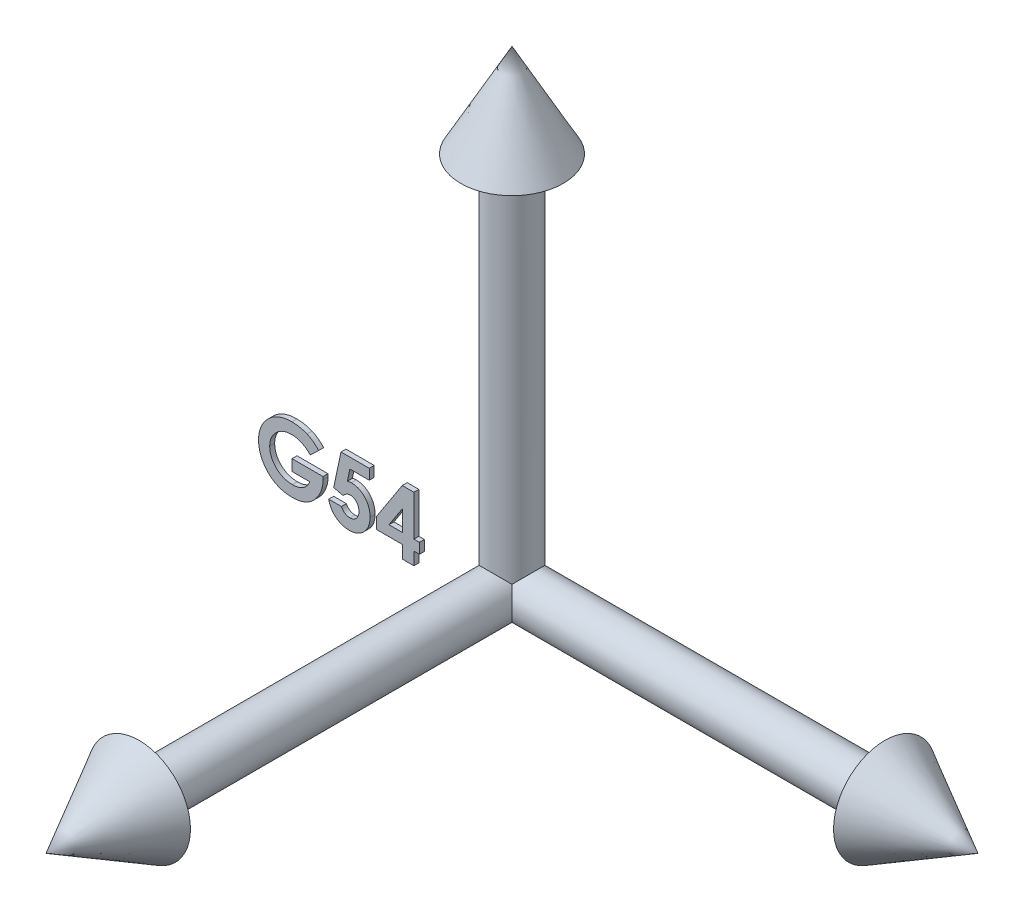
from build123d import *

# Parameters (mm, degrees)
SKETCH2_R             = 6.35
BOSS_EXTRUDE1_DEPTH   = 101.6
SKETCH4_R             = 13.97
SKETCH5_R             = 6.35
BOSS_EXTRUDE2_DEPTH   = 101.6
SKETCH7_R             = 13.97
SKETCH8_R             = 6.35
BOSS_EXTRUDE3_DEPTH   = 101.6
SKETCH10_R            = 13.97
SCALE1_SCALE          = 0.1875
BOSS_EXTRUDE4_DEPTH   = 0.127
BOSS_EXTRUDE4_2_DEPTH = 0.127
BOSS_EXTRUDE4_3_DEPTH = 0.127


with BuildPart() as part:
    # Sketch2 → Boss-Extrude1 (new body)
    with BuildSketch(Plane.XY):
        Circle(SKETCH2_R)
    extrude(amount=BOSS_EXTRUDE1_DEPTH)

    # Sketch4 → Loft1 section 0
    with BuildSketch(Plane.XY.offset(101.6), mode=Mode.PRIVATE) as loft1_s0:
        Circle(SKETCH4_R)
    loft([Vertex(0, 0, 127), loft1_s0.sketch])


with BuildPart() as body_2:
    # Sketch5 → Boss-Extrude2 (new body)
    with BuildSketch(Plane(origin=(0, 0, 0), x_dir=(0, 0, -1), z_dir=(1, 0, 0))):
        Circle(SKETCH5_R)
    extrude(amount=BOSS_EXTRUDE2_DEPTH)

    # Sketch7 → Loft2 section 0
    with BuildSketch(Plane(origin=(101.6, 0, 0), x_dir=(0, 0, -1), z_dir=(1, 0, 0)), mode=Mode.PRIVATE) as loft2_s0:
        Circle(SKETCH7_R)
    loft([loft2_s0.sketch, Vertex(127, 0, 0)])


with BuildPart() as body_3:
    # Sketch8 → Boss-Extrude3 (new body)
    with BuildSketch(Plane(origin=(0, 0, 0), x_dir=(1, 0, 0), z_dir=(0, 1, 0))):
        with Locations(Location((0, 0, 0), (0, 0, 270))):
            Circle(SKETCH8_R)
    extrude(amount=BOSS_EXTRUDE3_DEPTH)

    # Sketch10 → Loft3 section 0
    with BuildSketch(Plane(origin=(0, 101.6, 0), x_dir=(1, 0, 0), z_dir=(0, 1, 0)), mode=Mode.PRIVATE) as loft3_s0:
        Circle(SKETCH10_R)
    loft([loft3_s0.sketch, Vertex(0, 127, 0)])


with BuildPart() as part_1:
    # Scale1: scaled about (0, 0, 0)
    add(part.part.scale(SCALE1_SCALE))


with BuildPart() as body_2_1:
    # Scale1: scaled about (0, 0, 0)
    add(body_2.part.scale(SCALE1_SCALE))


with BuildPart() as body_3_1:
    # Scale1: scaled about (0, 0, 0)
    add(body_3.part.scale(SCALE1_SCALE))

    # Combine1: union body 2, part
    add(body_2_1.part)
    add(part_1.part)


with BuildPart() as body_4:
    # Sketch12 → Boss-Extrude4 (new, symmetric)
    with BuildSketch(Plane.XY):
        with BuildLine():
            Line((-9.751438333, 1.110672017), (-10.182658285, 0.697896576))
            add(Edge.make_bspline(
                [(-10.182658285, 0.697896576), (-10.216798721, 0.732077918), (-10.283787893, 0.799147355), (-10.393340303, 0.886442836), (-10.506803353, 0.960661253), (-10.624550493, 1.021688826), (-10.746745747, 1.069027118), (-10.87314797, 1.102889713), (-11.003962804, 1.122974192), (-11.092518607, 1.125785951), (-11.137320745, 1.127208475)],
                knots=[0, 0, 0, 0, 1.075575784, 2.110457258, 3.113929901, 4.09197124, 5.059417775, 6.02750972, 7.002078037, 8, 8, 8, 8], degree=3))
            add(Edge.make_bspline(
                [(-11.137320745, 1.127208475), (-11.176162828, 1.126211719), (-11.252432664, 1.1242545), (-11.364503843, 1.109391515), (-11.471594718, 1.084563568), (-11.574211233, 1.050168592), (-11.671726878, 1.005409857), (-11.764706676, 0.950978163), (-11.85257843, 0.886457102), (-11.934650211, 0.813069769), (-12.009376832, 0.732945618), (-12.074617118, 0.647184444), (-12.130187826, 0.557384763), (-12.175933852, 0.463087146), (-12.210741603, 0.364436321), (-12.235589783, 0.261503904), (-12.251362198, 0.154589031), (-12.253224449, 0.081650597), (-12.2541677, 0.044706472)],
                knots=[0, 0, 0, 0, 1.075001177, 2.110859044, 3.123021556, 4.114053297, 5.101481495, 6.087880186, 7.091499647, 8.114004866, 9.131394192, 10.11971144, 11.092043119, 12.050101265, 13.015322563, 13.981809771, 14.977764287, 16, 16, 16, 16], degree=3))
            add(Edge.make_bspline(
                [(-12.2541677, 0.044706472), (-12.253287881, 0.006483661), (-12.251554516, -0.068820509), (-12.234903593, -0.179332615), (-12.209249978, -0.285653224), (-12.171699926, -0.386993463), (-12.125487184, -0.484741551), (-12.066881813, -0.577004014), (-11.998542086, -0.665189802), (-11.920590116, -0.747763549), (-11.835798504, -0.823876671), (-11.743966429, -0.88953381), (-11.647887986, -0.946181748), (-11.546012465, -0.991045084), (-11.440108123, -1.027065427), (-11.329100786, -1.052462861), (-11.213240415, -1.068044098), (-11.134189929, -1.069917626), (-11.094071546, -1.070868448)],
                knots=[0, 0, 0, 0, 1.022067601, 2.013613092, 2.983553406, 3.943623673, 4.90013463, 5.87121881, 6.861774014, 7.881098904, 8.905697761, 9.905387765, 10.89678721, 11.884561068, 12.87834324, 13.885584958, 14.926927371, 16, 16, 16, 16], degree=3))
            add(Edge.make_bspline(
                [(-11.094071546, -1.070868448), (-11.067976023, -1.070632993), (-11.016744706, -1.070170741), (-10.941597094, -1.062667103), (-10.869623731, -1.051939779), (-10.800545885, -1.037738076), (-10.735061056, -1.017640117), (-10.672262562, -0.99413803), (-10.612518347, -0.966400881), (-10.556152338, -0.933471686), (-10.502325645, -0.896562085), (-10.451542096, -0.854329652), (-10.402910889, -0.807726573), (-10.357000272, -0.756183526), (-10.314587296, -0.699239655), (-10.274313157, -0.63794138), (-10.236638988, -0.571680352), (-10.214378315, -0.524890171), (-10.203010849, -0.500996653)],
                knots=[0, 0, 0, 0, 1.109579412, 2.178351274, 3.208885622, 4.204702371, 5.174744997, 6.119429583, 7.05542196, 7.97267548, 8.893247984, 9.828544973, 10.778894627, 11.756245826, 12.760884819, 13.796418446, 14.874735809, 16, 16, 16, 16], degree=3))
            Line((-10.203010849, -0.500996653), (-11.11442411, -0.500996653))
            Line((-11.11442411, -0.500996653), (-11.11442411, 0.068875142))
            Line((-11.11442411, 0.068875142), (-9.531376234, 0.068875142))
            Line((-9.531376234, 0.068875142), (-9.52692411, -0.066596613))
            add(Edge.make_bspline(
                [(-9.52692411, -0.066596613), (-9.527496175, -0.101389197), (-9.528639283, -0.170912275), (-9.539086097, -0.274420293), (-9.556391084, -0.376555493), (-9.580048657, -0.477215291), (-9.609697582, -0.57689346), (-9.647509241, -0.674635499), (-9.691786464, -0.771104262), (-9.74139595, -0.865889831), (-9.797142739, -0.956839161), (-9.857162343, -1.042956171), (-9.920599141, -1.12409181), (-9.988832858, -1.199115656), (-10.060800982, -1.268657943), (-10.136645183, -1.332451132), (-10.21663372, -1.390549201), (-10.300342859, -1.443442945), (-10.388249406, -1.489801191), (-10.47987005, -1.530126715), (-10.575066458, -1.564374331), (-10.674084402, -1.592449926), (-10.776729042, -1.614112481), (-10.883002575, -1.628966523), (-10.992963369, -1.639060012), (-11.06754745, -1.640173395), (-11.105519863, -1.640740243)],
                knots=[0, 0, 0, 0, 1.006889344, 2.011981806, 3.007738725, 4.003571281, 5.003404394, 6.015442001, 7.03424805, 8.074616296, 9.110249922, 10.119753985, 11.111721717, 12.089233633, 13.052717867, 14.006597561, 14.955430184, 15.912305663, 16.870361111, 17.829300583, 18.807640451, 19.796414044, 20.806216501, 21.841577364, 22.90109906, 24, 24, 24, 24], degree=3))
            add(Edge.make_bspline(
                [(-11.105519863, -1.640740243), (-11.146033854, -1.64018047), (-11.226344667, -1.639070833), (-11.345094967, -1.628678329), (-11.460400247, -1.611526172), (-11.572289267, -1.587788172), (-11.681021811, -1.558244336), (-11.786411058, -1.521159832), (-11.888241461, -1.477046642), (-11.986817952, -1.427072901), (-12.080880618, -1.370398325), (-12.170218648, -1.30801671), (-12.254344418, -1.239526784), (-12.334119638, -1.166075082), (-12.40768045, -1.085856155), (-12.477768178, -1.001470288), (-12.54098731, -0.909822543), (-12.600056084, -0.813884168), (-12.652533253, -0.713695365), (-12.698425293, -0.611109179), (-12.737561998, -0.506719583), (-12.768422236, -0.400040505), (-12.79347786, -0.2918158), (-12.811405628, -0.181574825), (-12.821530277, -0.069331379), (-12.823199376, 0.006102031), (-12.824039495, 0.044070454)],
                knots=[0, 0, 0, 0, 1.084149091, 2.14910686, 3.187506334, 4.202448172, 5.208724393, 6.201130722, 7.189831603, 8.176984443, 9.156919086, 10.126598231, 11.090766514, 12.05840148, 13.026036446, 14.001772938, 14.991905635, 16.003017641, 17.015720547, 18.016462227, 19.009322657, 19.99686681, 20.986544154, 21.980959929, 22.983742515, 24, 24, 24, 24], degree=3))
            add(Edge.make_bspline(
                [(-12.824039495, 0.044070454), (-12.822914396, 0.095867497), (-12.820692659, 0.198151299), (-12.800116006, 0.348815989), (-12.768040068, 0.494569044), (-12.722007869, 0.63487964), (-12.662937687, 0.769941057), (-12.591666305, 0.900070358), (-12.506645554, 1.025129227), (-12.440833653, 1.102558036), (-12.407447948, 1.14183688)],
                knots=[0, 0, 0, 0, 1.034044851, 2.041932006, 3.031217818, 4.011390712, 4.986069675, 5.97149666, 6.970960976, 8, 8, 8, 8], degree=3))
            add(Edge.make_bspline(
                [(-12.407447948, 1.14183688), (-12.38671909, 1.164560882), (-12.345572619, 1.209667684), (-12.279800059, 1.272344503), (-12.212359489, 1.331263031), (-12.142316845, 1.385173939), (-12.07004033, 1.435257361), (-11.995321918, 1.480574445), (-11.918553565, 1.52256811), (-11.839136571, 1.559094), (-11.757486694, 1.591842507), (-11.673242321, 1.619552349), (-11.587034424, 1.644096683), (-11.49809963, 1.662768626), (-11.407336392, 1.678317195), (-11.314100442, 1.688738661), (-11.218645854, 1.696376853), (-11.154085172, 1.696843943), (-11.121420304, 1.69708027)],
                knots=[0, 0, 0, 0, 1.020590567, 2.025856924, 3.013483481, 3.991664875, 4.957826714, 5.930500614, 6.890802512, 7.860442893, 8.829981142, 9.809047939, 10.802672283, 11.803273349, 12.823572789, 13.857849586, 14.916166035, 16, 16, 16, 16], degree=3))
            add(Edge.make_bspline(
                [(-11.121420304, 1.69708027), (-11.087274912, 1.696553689), (-11.019338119, 1.695505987), (-10.918327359, 1.688256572), (-10.818720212, 1.677072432), (-10.72093643, 1.660295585), (-10.624647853, 1.63960624), (-10.530352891, 1.613098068), (-10.437436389, 1.58298001), (-10.376948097, 1.558967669), (-10.346750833, 1.54698011)],
                knots=[0, 0, 0, 0, 1.03180557, 2.052914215, 3.058998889, 4.059601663, 5.049854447, 6.033765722, 7.018406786, 8, 8, 8, 8], degree=3))
            add(Edge.make_bspline(
                [(-10.346750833, 1.54698011), (-10.32134357, 1.535901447), (-10.269665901, 1.513367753), (-10.194481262, 1.472141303), (-10.119112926, 1.426437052), (-10.044374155, 1.374583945), (-9.970378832, 1.316678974), (-9.896354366, 1.253636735), (-9.823056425, 1.184722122), (-9.775620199, 1.135675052), (-9.751438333, 1.110672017)],
                knots=[0, 0, 0, 0, 0.894392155, 1.819168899, 2.76525314, 3.739198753, 4.75366411, 5.797420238, 6.877176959, 8, 8, 8, 8], degree=3))
        make_face()
    extrude(amount=BOSS_EXTRUDE4_DEPTH, both=True)


with BuildPart() as body_5:
    # Sketch12 → Boss-Extrude4 2 (new, symmetric)
    with BuildSketch(Plane.XY):
        with BuildLine():
            Line((-8.611694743, 1.615670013), (-7.166026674, 1.615670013))
            Line((-7.166026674, 1.615670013), (-7.166026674, 1.086503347))
            Line((-7.166026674, 1.086503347), (-8.160122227, 1.086503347))
            Line((-8.160122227, 1.086503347), (-8.284145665, 0.486102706))
            add(Edge.make_bspline(
                [(-8.284145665, 0.486102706), (-8.267245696, 0.49080956), (-8.233915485, 0.500092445), (-8.183703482, 0.509402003), (-8.135041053, 0.515436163), (-8.103109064, 0.51624104), (-8.087616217, 0.516631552)],
                knots=[0, 0, 0, 0, 1.05461699, 2.079921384, 3.068411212, 4, 4, 4, 4], degree=3))
            add(Edge.make_bspline(
                [(-8.087616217, 0.516631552), (-8.053855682, 0.515857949), (-7.987306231, 0.514333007), (-7.889952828, 0.499856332), (-7.796731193, 0.477056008), (-7.707926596, 0.444538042), (-7.623625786, 0.402215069), (-7.543726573, 0.351016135), (-7.468130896, 0.290851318), (-7.398181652, 0.221682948), (-7.333909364, 0.145734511), (-7.278028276, 0.063588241), (-7.230302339, -0.023584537), (-7.192342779, -0.116325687), (-7.162381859, -0.214052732), (-7.140731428, -0.316828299), (-7.127928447, -0.424774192), (-7.126202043, -0.498417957), (-7.125321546, -0.535977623)],
                knots=[0, 0, 0, 0, 1.01440847, 1.999622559, 2.951875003, 3.895578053, 4.836219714, 5.782137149, 6.743708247, 7.735272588, 8.734977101, 9.730283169, 10.717124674, 11.717316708, 12.737475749, 13.78628267, 14.87096371, 16, 16, 16, 16], degree=3))
            add(Edge.make_bspline(
                [(-7.125321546, -0.535977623), (-7.126397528, -0.573963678), (-7.128520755, -0.648921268), (-7.142372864, -0.75913544), (-7.166822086, -0.864695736), (-7.200405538, -0.965884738), (-7.244649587, -1.061958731), (-7.297859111, -1.153912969), (-7.36093374, -1.241064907), (-7.433254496, -1.32252113), (-7.511876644, -1.396973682), (-7.595590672, -1.462469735), (-7.683808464, -1.517584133), (-7.776532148, -1.562125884), (-7.87322974, -1.597366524), (-7.973930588, -1.623020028), (-8.079124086, -1.637730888), (-8.150536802, -1.639726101), (-8.186834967, -1.640740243)],
                knots=[0, 0, 0, 0, 1.06808661, 2.107647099, 3.116961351, 4.110378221, 5.100014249, 6.085620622, 7.093190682, 8.119403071, 9.144090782, 10.133780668, 11.103064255, 12.062861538, 13.020824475, 13.992378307, 14.979551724, 16, 16, 16, 16], degree=3))
            add(Edge.make_bspline(
                [(-8.186834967, -1.640740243), (-8.219295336, -1.639910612), (-8.283313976, -1.638274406), (-8.377610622, -1.628217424), (-8.468523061, -1.610436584), (-8.555568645, -1.584703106), (-8.639663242, -1.553031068), (-8.719834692, -1.5134192), (-8.796523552, -1.466621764), (-8.869512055, -1.413492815), (-8.937614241, -1.353645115), (-8.9997707, -1.288131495), (-9.056357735, -1.217777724), (-9.106164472, -1.141715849), (-9.149034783, -1.060058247), (-9.187053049, -0.973767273), (-9.218171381, -0.881941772), (-9.233963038, -0.818283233), (-9.241988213, -0.785932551)],
                knots=[0, 0, 0, 0, 1.054957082, 2.080596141, 3.077793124, 4.061112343, 5.027190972, 5.994718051, 6.962465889, 7.943658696, 8.924948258, 9.904494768, 10.875059, 11.855380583, 12.854004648, 13.869083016, 14.917087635, 16, 16, 16, 16], degree=3))
            Line((-9.241988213, -0.785932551), (-8.590706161, -0.785932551))
            add(Edge.make_bspline(
                [(-8.590706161, -0.785932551), (-8.57880071, -0.808350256), (-8.555663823, -0.851916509), (-8.51165235, -0.909757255), (-8.4623843, -0.959081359), (-8.408304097, -1.000370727), (-8.349061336, -1.031304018), (-8.287070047, -1.054762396), (-8.221551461, -1.068318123), (-8.17693041, -1.070012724), (-8.154398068, -1.070868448)],
                knots=[0, 0, 0, 0, 1.104910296, 2.147267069, 3.153527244, 4.136738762, 5.099945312, 6.05603338, 7.018353, 8, 8, 8, 8], degree=3))
            add(Edge.make_bspline(
                [(-8.154398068, -1.070868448), (-8.138693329, -1.070277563), (-8.107793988, -1.069114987), (-8.062268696, -1.062964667), (-8.018812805, -1.051316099), (-7.97710323, -1.035185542), (-7.937027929, -1.015068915), (-7.899161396, -0.989672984), (-7.86284482, -0.960441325), (-7.828631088, -0.926897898), (-7.797643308, -0.88950478), (-7.770470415, -0.849323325), (-7.746174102, -0.807246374), (-7.728177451, -0.761607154), (-7.713439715, -0.713768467), (-7.702586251, -0.663369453), (-7.696100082, -0.610351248), (-7.695499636, -0.574157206), (-7.695193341, -0.555694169)],
                knots=[0, 0, 0, 0, 0.978869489, 1.925942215, 2.855067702, 3.774946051, 4.70828698, 5.642468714, 6.60995405, 7.609372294, 8.622401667, 9.629904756, 10.629323, 11.642352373, 12.678539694, 13.745912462, 14.850161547, 16, 16, 16, 16], degree=3))
            add(Edge.make_bspline(
                [(-7.695193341, -0.555694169), (-7.695548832, -0.537659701), (-7.696240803, -0.502555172), (-7.701964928, -0.451009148), (-7.712205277, -0.4021013), (-7.72615784, -0.355457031), (-7.744018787, -0.311359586), (-7.765846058, -0.269546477), (-7.791732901, -0.230229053), (-7.821818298, -0.194207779), (-7.853901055, -0.161168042), (-7.888368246, -0.132271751), (-7.924909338, -0.108289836), (-7.962388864, -0.087352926), (-8.00230287, -0.0721155), (-8.04375385, -0.061622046), (-8.086698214, -0.053922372), (-8.115989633, -0.053469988), (-8.130865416, -0.053240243)],
                knots=[0, 0, 0, 0, 1.166249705, 2.270133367, 3.348514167, 4.393962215, 5.415026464, 6.420877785, 7.440098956, 8.453121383, 9.451844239, 10.415694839, 11.355045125, 12.27538808, 13.187007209, 14.108269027, 15.039275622, 16, 16, 16, 16], degree=3))
            add(Edge.make_bspline(
                [(-8.130865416, -0.053240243), (-8.147023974, -0.053853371), (-8.179409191, -0.05508221), (-8.227525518, -0.065080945), (-8.275061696, -0.081262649), (-8.322282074, -0.103587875), (-8.368717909, -0.132804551), (-8.415594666, -0.167072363), (-8.461343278, -0.208881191), (-8.490431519, -0.240020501), (-8.505479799, -0.256129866)],
                knots=[0, 0, 0, 0, 0.88288272, 1.769486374, 2.674910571, 3.623812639, 4.617874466, 5.670434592, 6.794841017, 8, 8, 8, 8], degree=3))
            Line((-8.505479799, -0.256129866), (-8.985037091, -0.146098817))
            Line((-8.985037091, -0.146098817), (-8.611694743, 1.615670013))
        make_face()
    extrude(amount=BOSS_EXTRUDE4_2_DEPTH, both=True)


with BuildPart() as body_6:
    # Sketch12 → Boss-Extrude4 3 (new, symmetric)
    with BuildSketch(Plane.XY):
        Polygon((-5.480579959, 1.69708027), (-4.886539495, 1.69708027), (-4.886539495, -0.378881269), (-4.601603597, -0.378881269), (-4.601603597, -0.908047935), (-4.886539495, -0.908047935), (-4.886539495, -1.559329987), (-5.45641129, -1.559329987), (-5.45641129, -0.908047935), (-6.79968052, -0.908047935), (-6.79968052, -0.331179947), align=None)
        Polygon((-5.45641129, -0.378881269), (-5.45641129, 0.701712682), (-6.159210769, -0.378881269), align=None, mode=Mode.SUBTRACT)
    extrude(amount=BOSS_EXTRUDE4_3_DEPTH, both=True)


solid = Compound([body_3_1.part, body_4.part, body_5.part, body_6.part])
